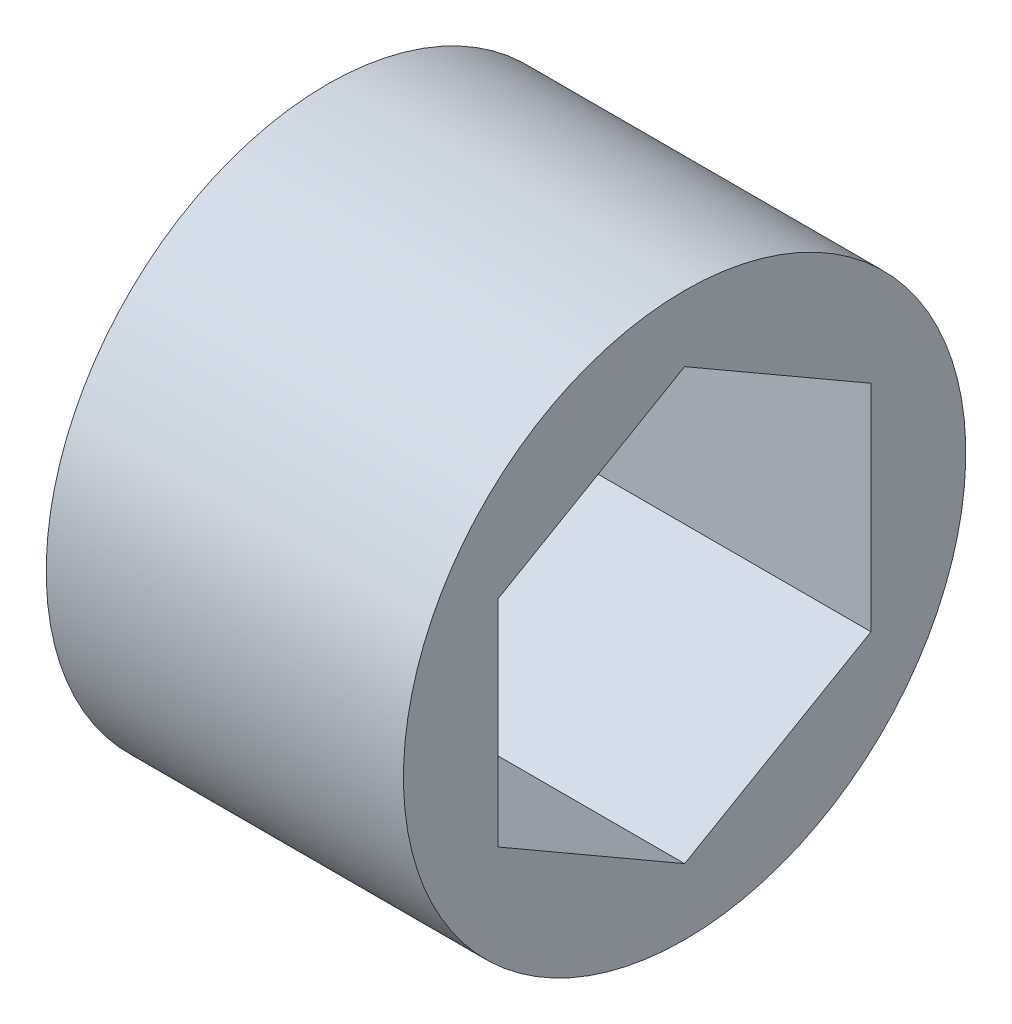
ISO-10303-21;
HEADER;
FILE_DESCRIPTION(('STEP AP214'),'2;1');
FILE_NAME('part.step','',(''),(''),'','','');
FILE_SCHEMA(('AUTOMOTIVE_DESIGN { 1 0 10303 214 1 1 1 1 }'));
ENDSEC;
DATA;
#1=APPLICATION_CONTEXT('core data for automotive mechanical design processes');
#2=APPLICATION_PROTOCOL_DEFINITION('international standard','automotive_design',2000,#1);
#3=PRODUCT_CONTEXT('',#1,'mechanical');
#4=PRODUCT('Part','Part','',(#3));
#5=PRODUCT_RELATED_PRODUCT_CATEGORY('part','',(#4));
#6=PRODUCT_DEFINITION_FORMATION('','',#4);
#7=PRODUCT_DEFINITION_CONTEXT('part definition',#1,'design');
#8=PRODUCT_DEFINITION('design','',#6,#7);
#9=PRODUCT_DEFINITION_SHAPE('','',#8);
#10=(LENGTH_UNIT() NAMED_UNIT(*) SI_UNIT(.MILLI.,.METRE.));
#11=(NAMED_UNIT(*) PLANE_ANGLE_UNIT() SI_UNIT($,.RADIAN.));
#12=(NAMED_UNIT(*) SI_UNIT($,.STERADIAN.) SOLID_ANGLE_UNIT());
#13=UNCERTAINTY_MEASURE_WITH_UNIT(LENGTH_MEASURE(1.E-05),#10,'distance_accuracy_value','');
#14=(GEOMETRIC_REPRESENTATION_CONTEXT(3) GLOBAL_UNCERTAINTY_ASSIGNED_CONTEXT((#13)) GLOBAL_UNIT_ASSIGNED_CONTEXT((#10,
#11,#12)) REPRESENTATION_CONTEXT('',''));
#15=CARTESIAN_POINT('',(0.,0.,0.));
#16=DIRECTION('',(0.,0.,1.));
#17=DIRECTION('',(1.,0.,0.));
#18=AXIS2_PLACEMENT_3D('',#15,#16,#17);
#19=CARTESIAN_POINT('',(-149.86,-96.8727012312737,310.598502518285));
#20=DIRECTION('',(1.,0.,0.));
#21=DIRECTION('',(0.,-1.,0.));
#22=AXIS2_PLACEMENT_3D('',#19,#20,#21);
#23=PLANE('',#22);
#24=CARTESIAN_POINT('',(-149.86,-96.8727012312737,310.598502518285));
#25=DIRECTION('',(1.,0.,0.));
#26=DIRECTION('',(0.,1.,0.));
#27=AXIS2_PLACEMENT_3D('',#24,#25,#26);
#28=CIRCLE('',#27,9.9949);
#29=CARTESIAN_POINT('',(-149.86,-86.8778012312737,310.598502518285));
#30=VERTEX_POINT('',#29);
#31=EDGE_CURVE('E11',#30,#30,#28,.T.);
#32=ORIENTED_EDGE('',*,*,#31,.F.);
#33=EDGE_LOOP('',(#32));
#34=FACE_BOUND('',#33,.T.);
#35=DIRECTION('',(0.,-1.,0.));
#36=VECTOR('',#35,1.);
#37=CARTESIAN_POINT('',(-149.86,-96.8727012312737,317.22401254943));
#38=LINE('',#37,#36);
#39=CARTESIAN_POINT('',(-149.86,-93.0474612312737,317.22401254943));
#40=VERTEX_POINT('',#39);
#41=CARTESIAN_POINT('',(-149.86,-100.697941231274,317.22401254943));
#42=VERTEX_POINT('',#41);
#43=EDGE_CURVE('E226',#40,#42,#38,.T.);
#44=ORIENTED_EDGE('',*,*,#43,.T.);
#45=DIRECTION('',(0.,-0.5,-0.866025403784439));
#46=VECTOR('',#45,1.);
#47=CARTESIAN_POINT('',(-149.86,-102.610561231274,313.911257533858));
#48=LINE('',#47,#46);
#49=CARTESIAN_POINT('',(-149.86,-104.523181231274,310.598502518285));
#50=VERTEX_POINT('',#49);
#51=EDGE_CURVE('E103',#42,#50,#48,.T.);
#52=ORIENTED_EDGE('',*,*,#51,.T.);
#53=DIRECTION('',(0.,0.5,-0.866025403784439));
#54=VECTOR('',#53,1.);
#55=CARTESIAN_POINT('',(-149.86,-102.610561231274,307.285747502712));
#56=LINE('',#55,#54);
#57=CARTESIAN_POINT('',(-149.86,-100.697941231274,303.97299248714));
#58=VERTEX_POINT('',#57);
#59=EDGE_CURVE('E115',#50,#58,#56,.T.);
#60=ORIENTED_EDGE('',*,*,#59,.T.);
#61=DIRECTION('',(0.,1.,0.));
#62=VECTOR('',#61,1.);
#63=CARTESIAN_POINT('',(-149.86,-96.8727012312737,303.97299248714));
#64=LINE('',#63,#62);
#65=CARTESIAN_POINT('',(-149.86,-93.0474612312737,303.97299248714));
#66=VERTEX_POINT('',#65);
#67=EDGE_CURVE('E118',#58,#66,#64,.T.);
#68=ORIENTED_EDGE('',*,*,#67,.T.);
#69=DIRECTION('',(0.,0.5,0.866025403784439));
#70=VECTOR('',#69,1.);
#71=CARTESIAN_POINT('',(-149.86,-91.1348412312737,307.285747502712));
#72=LINE('',#71,#70);
#73=CARTESIAN_POINT('',(-149.86,-89.2222212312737,310.598502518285));
#74=VERTEX_POINT('',#73);
#75=EDGE_CURVE('E251',#66,#74,#72,.T.);
#76=ORIENTED_EDGE('',*,*,#75,.T.);
#77=DIRECTION('',(0.,-0.5,0.866025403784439));
#78=VECTOR('',#77,1.);
#79=CARTESIAN_POINT('',(-149.86,-91.1348412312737,313.911257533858));
#80=LINE('',#79,#78);
#81=EDGE_CURVE('E228',#74,#40,#80,.T.);
#82=ORIENTED_EDGE('',*,*,#81,.T.);
#83=EDGE_LOOP('',(#44,#52,#60,#68,#76,#82));
#84=FACE_BOUND('',#83,.T.);
#85=ADVANCED_FACE('F17',(#34,#84),#23,.F.);
#86=CARTESIAN_POINT('',(-137.16,-96.8727012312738,310.598502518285));
#87=DIRECTION('',(1.,0.,0.));
#88=DIRECTION('',(0.,-1.,0.));
#89=AXIS2_PLACEMENT_3D('',#86,#87,#88);
#90=PLANE('',#89);
#91=CARTESIAN_POINT('',(-137.16,-96.8727012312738,310.598502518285));
#92=DIRECTION('',(1.,0.,0.));
#93=DIRECTION('',(0.,1.,0.));
#94=AXIS2_PLACEMENT_3D('',#91,#92,#93);
#95=CIRCLE('',#94,9.9949);
#96=CARTESIAN_POINT('',(-137.16,-86.8778012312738,310.598502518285));
#97=VERTEX_POINT('',#96);
#98=EDGE_CURVE('E25',#97,#97,#95,.T.);
#99=ORIENTED_EDGE('',*,*,#98,.T.);
#100=EDGE_LOOP('',(#99));
#101=FACE_BOUND('',#100,.T.);
#102=DIRECTION('',(0.,-1.,0.));
#103=VECTOR('',#102,1.);
#104=CARTESIAN_POINT('',(-137.16,-96.8727012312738,317.22401254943));
#105=LINE('',#104,#103);
#106=CARTESIAN_POINT('',(-137.16,-93.0474612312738,317.22401254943));
#107=VERTEX_POINT('',#106);
#108=CARTESIAN_POINT('',(-137.16,-100.697941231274,317.22401254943));
#109=VERTEX_POINT('',#108);
#110=EDGE_CURVE('E238',#107,#109,#105,.T.);
#111=ORIENTED_EDGE('',*,*,#110,.F.);
#112=DIRECTION('',(0.,-0.5,0.866025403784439));
#113=VECTOR('',#112,1.);
#114=CARTESIAN_POINT('',(-137.16,-91.1348412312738,313.911257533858));
#115=LINE('',#114,#113);
#116=CARTESIAN_POINT('',(-137.16,-89.2222212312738,310.598502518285));
#117=VERTEX_POINT('',#116);
#118=EDGE_CURVE('E258',#117,#107,#115,.T.);
#119=ORIENTED_EDGE('',*,*,#118,.F.);
#120=DIRECTION('',(0.,0.5,0.866025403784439));
#121=VECTOR('',#120,1.);
#122=CARTESIAN_POINT('',(-137.16,-91.1348412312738,307.285747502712));
#123=LINE('',#122,#121);
#124=CARTESIAN_POINT('',(-137.16,-93.0474612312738,303.97299248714));
#125=VERTEX_POINT('',#124);
#126=EDGE_CURVE('E110',#125,#117,#123,.T.);
#127=ORIENTED_EDGE('',*,*,#126,.F.);
#128=DIRECTION('',(0.,1.,0.));
#129=VECTOR('',#128,1.);
#130=CARTESIAN_POINT('',(-137.16,-96.8727012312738,303.97299248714));
#131=LINE('',#130,#129);
#132=CARTESIAN_POINT('',(-137.16,-100.697941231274,303.97299248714));
#133=VERTEX_POINT('',#132);
#134=EDGE_CURVE('E106',#133,#125,#131,.T.);
#135=ORIENTED_EDGE('',*,*,#134,.F.);
#136=DIRECTION('',(0.,0.5,-0.866025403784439));
#137=VECTOR('',#136,1.);
#138=CARTESIAN_POINT('',(-137.16,-102.610561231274,307.285747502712));
#139=LINE('',#138,#137);
#140=CARTESIAN_POINT('',(-137.16,-104.523181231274,310.598502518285));
#141=VERTEX_POINT('',#140);
#142=EDGE_CURVE('E92',#141,#133,#139,.T.);
#143=ORIENTED_EDGE('',*,*,#142,.F.);
#144=DIRECTION('',(0.,-0.5,-0.866025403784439));
#145=VECTOR('',#144,1.);
#146=CARTESIAN_POINT('',(-137.16,-102.610561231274,313.911257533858));
#147=LINE('',#146,#145);
#148=EDGE_CURVE('E130',#109,#141,#147,.T.);
#149=ORIENTED_EDGE('',*,*,#148,.F.);
#150=EDGE_LOOP('',(#111,#119,#127,#135,#143,#149));
#151=FACE_BOUND('',#150,.T.);
#152=ADVANCED_FACE('F108',(#101,#151),#90,.T.);
#153=CARTESIAN_POINT('',(-137.16,-96.8727012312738,310.598502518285));
#154=DIRECTION('',(-1.,0.,0.));
#155=DIRECTION('',(0.,-1.,0.));
#156=AXIS2_PLACEMENT_3D('',#153,#154,#155);
#157=CYLINDRICAL_SURFACE('',#156,9.9949);
#158=ORIENTED_EDGE('',*,*,#31,.T.);
#159=EDGE_LOOP('',(#158));
#160=FACE_BOUND('',#159,.T.);
#161=ORIENTED_EDGE('',*,*,#98,.F.);
#162=EDGE_LOOP('',(#161));
#163=FACE_BOUND('',#162,.T.);
#164=ADVANCED_FACE('F162',(#160,#163),#157,.T.);
#165=CARTESIAN_POINT('',(-137.16,-102.610561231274,313.911257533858));
#166=DIRECTION('',(0.,0.866025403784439,-0.5));
#167=DIRECTION('',(-1.,0.,0.));
#168=AXIS2_PLACEMENT_3D('',#165,#166,#167);
#169=PLANE('',#168);
#170=ORIENTED_EDGE('',*,*,#51,.F.);
#171=DIRECTION('',(-1.,0.,0.));
#172=VECTOR('',#171,1.);
#173=CARTESIAN_POINT('',(-137.16,-100.697941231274,317.22401254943));
#174=LINE('',#173,#172);
#175=EDGE_CURVE('E243',#109,#42,#174,.T.);
#176=ORIENTED_EDGE('',*,*,#175,.F.);
#177=ORIENTED_EDGE('',*,*,#148,.T.);
#178=DIRECTION('',(-1.,0.,0.));
#179=VECTOR('',#178,1.);
#180=CARTESIAN_POINT('',(-137.16,-104.523181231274,310.598502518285));
#181=LINE('',#180,#179);
#182=EDGE_CURVE('E100',#141,#50,#181,.T.);
#183=ORIENTED_EDGE('',*,*,#182,.T.);
#184=EDGE_LOOP('',(#170,#176,#177,#183));
#185=FACE_BOUND('',#184,.T.);
#186=ADVANCED_FACE('F158',(#185),#169,.T.);
#187=CARTESIAN_POINT('',(-137.16,-102.610561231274,307.285747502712));
#188=DIRECTION('',(0.,0.866025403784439,0.5));
#189=DIRECTION('',(1.,0.,0.));
#190=AXIS2_PLACEMENT_3D('',#187,#188,#189);
#191=PLANE('',#190);
#192=ORIENTED_EDGE('',*,*,#59,.F.);
#193=ORIENTED_EDGE('',*,*,#182,.F.);
#194=ORIENTED_EDGE('',*,*,#142,.T.);
#195=DIRECTION('',(-1.,0.,0.));
#196=VECTOR('',#195,1.);
#197=CARTESIAN_POINT('',(-137.16,-100.697941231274,303.97299248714));
#198=LINE('',#197,#196);
#199=EDGE_CURVE('E97',#133,#58,#198,.T.);
#200=ORIENTED_EDGE('',*,*,#199,.T.);
#201=EDGE_LOOP('',(#192,#193,#194,#200));
#202=FACE_BOUND('',#201,.T.);
#203=ADVANCED_FACE('F95',(#202),#191,.T.);
#204=CARTESIAN_POINT('',(-137.16,-96.8727012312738,303.97299248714));
#205=DIRECTION('',(0.,0.,1.));
#206=DIRECTION('',(1.,0.,0.));
#207=AXIS2_PLACEMENT_3D('',#204,#205,#206);
#208=PLANE('',#207);
#209=ORIENTED_EDGE('',*,*,#67,.F.);
#210=ORIENTED_EDGE('',*,*,#199,.F.);
#211=ORIENTED_EDGE('',*,*,#134,.T.);
#212=DIRECTION('',(-1.,0.,0.));
#213=VECTOR('',#212,1.);
#214=CARTESIAN_POINT('',(-137.16,-93.0474612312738,303.97299248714));
#215=LINE('',#214,#213);
#216=EDGE_CURVE('E248',#125,#66,#215,.T.);
#217=ORIENTED_EDGE('',*,*,#216,.T.);
#218=EDGE_LOOP('',(#209,#210,#211,#217));
#219=FACE_BOUND('',#218,.T.);
#220=ADVANCED_FACE('F117',(#219),#208,.T.);
#221=CARTESIAN_POINT('',(-137.16,-91.1348412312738,307.285747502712));
#222=DIRECTION('',(0.,-0.866025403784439,0.5));
#223=DIRECTION('',(-1.,0.,0.));
#224=AXIS2_PLACEMENT_3D('',#221,#222,#223);
#225=PLANE('',#224);
#226=ORIENTED_EDGE('',*,*,#75,.F.);
#227=ORIENTED_EDGE('',*,*,#216,.F.);
#228=ORIENTED_EDGE('',*,*,#126,.T.);
#229=DIRECTION('',(-1.,0.,0.));
#230=VECTOR('',#229,1.);
#231=CARTESIAN_POINT('',(-137.16,-89.2222212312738,310.598502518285));
#232=LINE('',#231,#230);
#233=EDGE_CURVE('E254',#117,#74,#232,.T.);
#234=ORIENTED_EDGE('',*,*,#233,.T.);
#235=EDGE_LOOP('',(#226,#227,#228,#234));
#236=FACE_BOUND('',#235,.T.);
#237=ADVANCED_FACE('F153',(#236),#225,.T.);
#238=CARTESIAN_POINT('',(-137.16,-91.1348412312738,313.911257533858));
#239=DIRECTION('',(0.,-0.866025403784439,-0.5));
#240=DIRECTION('',(0.,0.5,-0.866025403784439));
#241=AXIS2_PLACEMENT_3D('',#238,#239,#240);
#242=PLANE('',#241);
#243=ORIENTED_EDGE('',*,*,#81,.F.);
#244=ORIENTED_EDGE('',*,*,#233,.F.);
#245=ORIENTED_EDGE('',*,*,#118,.T.);
#246=DIRECTION('',(-1.,0.,0.));
#247=VECTOR('',#246,1.);
#248=CARTESIAN_POINT('',(-137.16,-93.0474612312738,317.22401254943));
#249=LINE('',#248,#247);
#250=EDGE_CURVE('E233',#107,#40,#249,.T.);
#251=ORIENTED_EDGE('',*,*,#250,.T.);
#252=EDGE_LOOP('',(#243,#244,#245,#251));
#253=FACE_BOUND('',#252,.T.);
#254=ADVANCED_FACE('F144',(#253),#242,.T.);
#255=CARTESIAN_POINT('',(-137.16,-96.8727012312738,317.22401254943));
#256=DIRECTION('',(0.,0.,-1.));
#257=DIRECTION('',(0.,-1.,0.));
#258=AXIS2_PLACEMENT_3D('',#255,#256,#257);
#259=PLANE('',#258);
#260=ORIENTED_EDGE('',*,*,#43,.F.);
#261=ORIENTED_EDGE('',*,*,#250,.F.);
#262=ORIENTED_EDGE('',*,*,#110,.T.);
#263=ORIENTED_EDGE('',*,*,#175,.T.);
#264=EDGE_LOOP('',(#260,#261,#262,#263));
#265=FACE_BOUND('',#264,.T.);
#266=ADVANCED_FACE('F139',(#265),#259,.T.);
#267=CLOSED_SHELL('',(#85,#152,#164,#186,#203,#220,#237,#254,#266));
#268=MANIFOLD_SOLID_BREP('B1',#267);
#269=ADVANCED_BREP_SHAPE_REPRESENTATION('',(#18,#268),#14);
#270=SHAPE_DEFINITION_REPRESENTATION(#9,#269);
ENDSEC;
END-ISO-10303-21;
